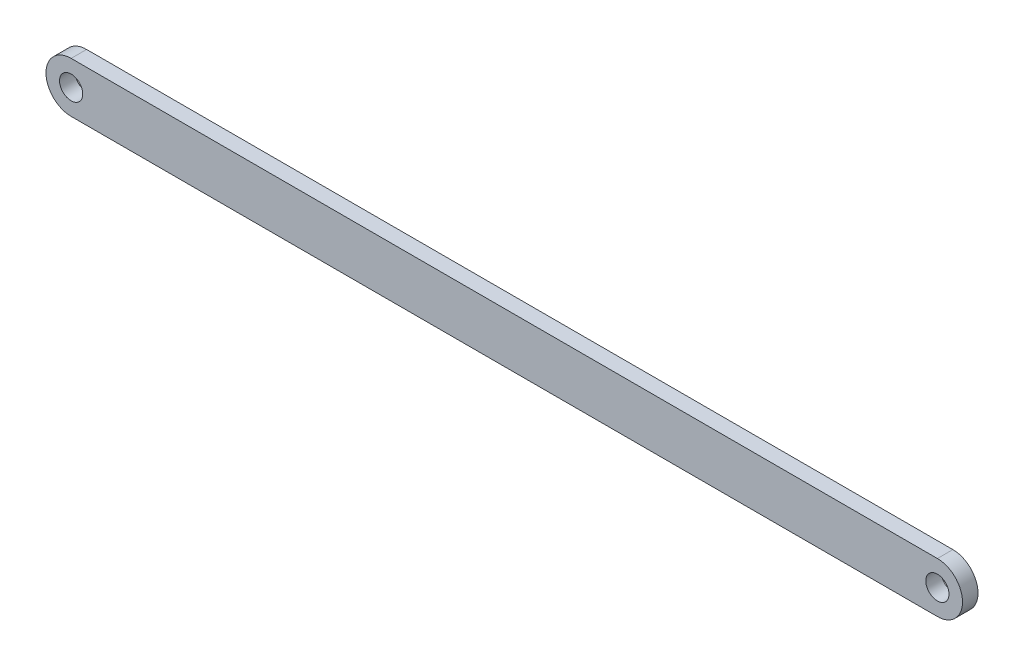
from build123d import *

# Parameters (mm, degrees)
SKETCH1_R      = 9.525
EXTRUDE1_DEPTH = 12.7


with BuildPart() as part:
    # Sketch1 → Extrude1 (new body)
    with BuildSketch(Plane.XY):
        with BuildLine():
            Line((0, 20.6375), (711.2, 20.6375))
            ThreePointArc((711.2, 20.6375), (731.8375, 0), (711.2, -20.6375))
            Line((711.2, -20.6375), (0, -20.6375))
            ThreePointArc((0, -20.6375), (-20.6375, 0), (0, 20.6375))
        make_face()
        Circle(SKETCH1_R, mode=Mode.SUBTRACT)
        with Locations((711.2, 0)):
            Circle(SKETCH1_R, mode=Mode.SUBTRACT)
    extrude(amount=EXTRUDE1_DEPTH)


solid = part.part
